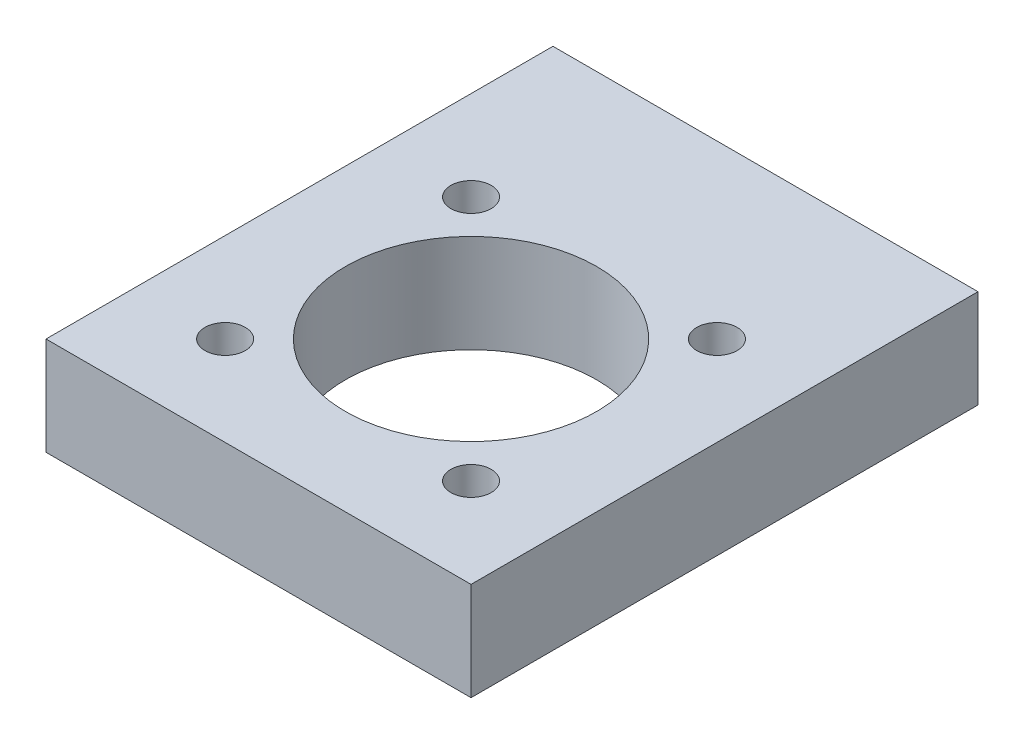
from build123d import *

# Parameters (mm, degrees)
BOSS_EXTRUDE1_DEPTH = 12.7
CUT_EXTRUDE1_REACH  = 50.674
SKETCH1_R           = 2.60985
CUT_EXTRUDE2_REACH  = 50.674
SKETCH3_R           = 16.256
SKETCH5_R           = 1.89865
CUT_EXTRUDE3_DEPTH  = 12.7


with BuildPart() as part:
    # Sketch2 → Boss-Extrude1 (new body)
    with BuildSketch(Plane(origin=(0, 0, 0), x_dir=(1, 0, 0), z_dir=(0, 1, 0))):
        Polygon((-27.5, 0), (-27.5, 38.1), (27.5, 38.1), (27.5, 0), (27.5, -27.5), (-27.5, -27.5), align=None)
    extrude(amount=BOSS_EXTRUDE1_DEPTH)

    # Sketch1 → Cut-Extrude1 (cut, up to next)
    with BuildSketch(Plane(origin=(0, 0, 0), x_dir=(1, 0, 0), z_dir=(0, 1, 0)), mode=Mode.PRIVATE) as cut_extrude1_sk1:
        with Locations(Location((15.909902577, 15.909902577, 0), (0, 0, 90))):
            Circle(SKETCH1_R)
    cut_extrude1_tool1 = extrude(cut_extrude1_sk1.sketch, amount=CUT_EXTRUDE1_REACH, mode=Mode.PRIVATE) & part.part
    # Sketch1 → Cut-Extrude1 (cut, up to next)
    with BuildSketch(Plane(origin=(0, 0, 0), x_dir=(1, 0, 0), z_dir=(0, 1, 0)), mode=Mode.PRIVATE) as cut_extrude1_sk2:
        with Locations(Location((-15.909902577, 15.909902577, 0), (0, 0, 90))):
            Circle(SKETCH1_R)
    cut_extrude1_tool2 = extrude(cut_extrude1_sk2.sketch, amount=CUT_EXTRUDE1_REACH, mode=Mode.PRIVATE) & part.part
    # Sketch1 → Cut-Extrude1 (cut, up to next)
    with BuildSketch(Plane(origin=(0, 0, 0), x_dir=(1, 0, 0), z_dir=(0, 1, 0)), mode=Mode.PRIVATE) as cut_extrude1_sk3:
        with Locations(Location((15.909902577, -15.909902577, 0), (0, 0, 90))):
            Circle(SKETCH1_R)
    cut_extrude1_tool3 = extrude(cut_extrude1_sk3.sketch, amount=CUT_EXTRUDE1_REACH, mode=Mode.PRIVATE) & part.part
    # Sketch1 → Cut-Extrude1 (cut, up to next)
    with BuildSketch(Plane(origin=(0, 0, 0), x_dir=(1, 0, 0), z_dir=(0, 1, 0)), mode=Mode.PRIVATE) as cut_extrude1_sk4:
        with Locations(Location((-15.909902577, -15.909902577, 0), (0, 0, 90))):
            Circle(SKETCH1_R)
    cut_extrude1_tool4 = extrude(cut_extrude1_sk4.sketch, amount=CUT_EXTRUDE1_REACH, mode=Mode.PRIVATE) & part.part
    add(cut_extrude1_tool1.solids().sort_by_distance((15.909903, 0, -15.909903))[0], mode=Mode.SUBTRACT)
    add(cut_extrude1_tool2.solids().sort_by_distance((-15.909903, 0, -15.909903))[0], mode=Mode.SUBTRACT)
    add(cut_extrude1_tool3.solids().sort_by_distance((15.909903, 0, 15.909903))[0], mode=Mode.SUBTRACT)
    add(cut_extrude1_tool4.solids().sort_by_distance((-15.909903, 0, 15.909903))[0], mode=Mode.SUBTRACT)

    # Sketch3 → Cut-Extrude2 (cut, up to next)
    with BuildSketch(Plane.XZ, mode=Mode.PRIVATE) as cut_extrude2_sk1:
        with Locations(Location((0, 0, 0), (0, 0, 270))):
            Circle(SKETCH3_R)
    cut_extrude2_tool1 = extrude(cut_extrude2_sk1.sketch, amount=-CUT_EXTRUDE2_REACH, mode=Mode.PRIVATE) & part.part
    add(cut_extrude2_tool1.solids().sort_by_distance((0, 0, 0))[0], mode=Mode.SUBTRACT)

    # Sketch5 → Cut-Extrude3 (cut)
    with BuildSketch(Plane(origin=(0, 0, -38.1), x_dir=(-1, 0, 0), z_dir=(0, 0, -1))):
        with Locations((6.35, 6.35)):
            Circle(SKETCH5_R)
        with Locations((19.05, 6.35)):
            Circle(SKETCH5_R)
        with Locations(Location((-19.05, 6.35, 0), (0, 0, 180))):
            Circle(SKETCH5_R)
        with Locations(Location((-6.35, 6.35, 0), (0, 0, 180))):
            Circle(SKETCH5_R)
    extrude(amount=-CUT_EXTRUDE3_DEPTH, mode=Mode.SUBTRACT)


solid = part.part
